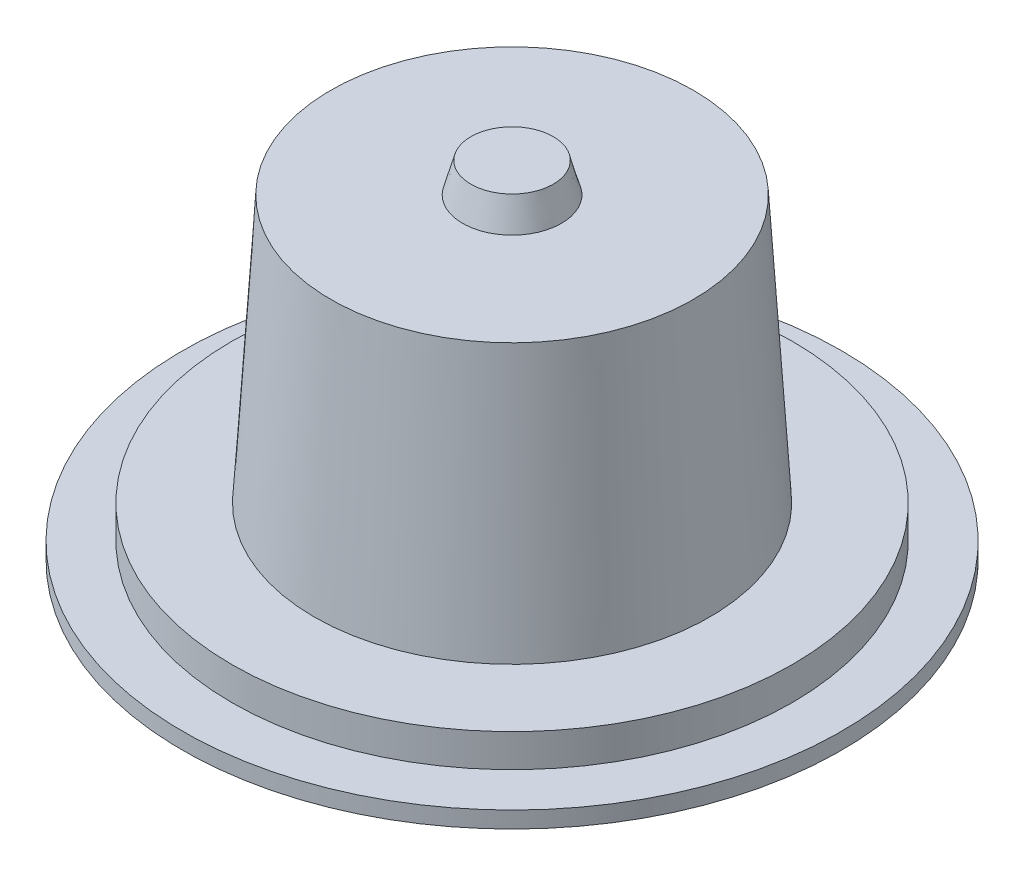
ISO-10303-21;
HEADER;
FILE_DESCRIPTION(('STEP AP214'),'2;1');
FILE_NAME('part.step','',(''),(''),'','','');
FILE_SCHEMA(('AUTOMOTIVE_DESIGN { 1 0 10303 214 1 1 1 1 }'));
ENDSEC;
DATA;
#1=APPLICATION_CONTEXT('core data for automotive mechanical design processes');
#2=APPLICATION_PROTOCOL_DEFINITION('international standard','automotive_design',2000,#1);
#3=PRODUCT_CONTEXT('',#1,'mechanical');
#4=PRODUCT('Part','Part','',(#3));
#5=PRODUCT_RELATED_PRODUCT_CATEGORY('part','',(#4));
#6=PRODUCT_DEFINITION_FORMATION('','',#4);
#7=PRODUCT_DEFINITION_CONTEXT('part definition',#1,'design');
#8=PRODUCT_DEFINITION('design','',#6,#7);
#9=PRODUCT_DEFINITION_SHAPE('','',#8);
#10=(LENGTH_UNIT() NAMED_UNIT(*) SI_UNIT(.MILLI.,.METRE.));
#11=(NAMED_UNIT(*) PLANE_ANGLE_UNIT() SI_UNIT($,.RADIAN.));
#12=(NAMED_UNIT(*) SI_UNIT($,.STERADIAN.) SOLID_ANGLE_UNIT());
#13=UNCERTAINTY_MEASURE_WITH_UNIT(LENGTH_MEASURE(1.E-05),#10,'distance_accuracy_value','');
#14=(GEOMETRIC_REPRESENTATION_CONTEXT(3) GLOBAL_UNCERTAINTY_ASSIGNED_CONTEXT((#13)) GLOBAL_UNIT_ASSIGNED_CONTEXT((#10,
#11,#12)) REPRESENTATION_CONTEXT('',''));
#15=CARTESIAN_POINT('',(0.,0.,0.));
#16=DIRECTION('',(0.,0.,1.));
#17=DIRECTION('',(1.,0.,0.));
#18=AXIS2_PLACEMENT_3D('',#15,#16,#17);
#19=CARTESIAN_POINT('',(0.,0.,0.));
#20=DIRECTION('',(0.,-1.,0.));
#21=DIRECTION('',(0.,0.,-1.));
#22=AXIS2_PLACEMENT_3D('',#19,#20,#21);
#23=CYLINDRICAL_SURFACE('',#22,50.);
#24=CARTESIAN_POINT('',(0.,10.,0.));
#25=DIRECTION('',(0.,-1.,0.));
#26=DIRECTION('',(0.,0.,-1.));
#27=AXIS2_PLACEMENT_3D('',#24,#25,#26);
#28=CIRCLE('',#27,50.);
#29=CARTESIAN_POINT('',(0.,10.,-50.));
#30=VERTEX_POINT('',#29);
#31=EDGE_CURVE('E10',#30,#30,#28,.T.);
#32=ORIENTED_EDGE('',*,*,#31,.F.);
#33=EDGE_LOOP('',(#32));
#34=FACE_BOUND('',#33,.T.);
#35=CARTESIAN_POINT('',(0.,0.,0.));
#36=DIRECTION('',(0.,-1.,0.));
#37=DIRECTION('',(0.,0.,-1.));
#38=AXIS2_PLACEMENT_3D('',#35,#36,#37);
#39=CIRCLE('',#38,50.);
#40=CARTESIAN_POINT('',(0.,0.,-50.));
#41=VERTEX_POINT('',#40);
#42=EDGE_CURVE('E88',#41,#41,#39,.T.);
#43=ORIENTED_EDGE('',*,*,#42,.T.);
#44=EDGE_LOOP('',(#43));
#45=FACE_BOUND('',#44,.T.);
#46=ADVANCED_FACE('F41',(#34,#45),#23,.F.);
#47=CARTESIAN_POINT('',(0.,10.,0.));
#48=DIRECTION('',(0.,1.,0.));
#49=DIRECTION('',(0.,0.,1.));
#50=AXIS2_PLACEMENT_3D('',#47,#48,#49);
#51=PLANE('',#50);
#52=ORIENTED_EDGE('',*,*,#31,.T.);
#53=EDGE_LOOP('',(#52));
#54=FACE_BOUND('',#53,.T.);
#55=ADVANCED_FACE('F106',(#54),#51,.F.);
#56=CARTESIAN_POINT('',(0.,110.,0.));
#57=DIRECTION('',(0.,-1.,0.));
#58=DIRECTION('',(0.,0.,-1.));
#59=AXIS2_PLACEMENT_3D('',#56,#57,#58);
#60=PLANE('',#59);
#61=CARTESIAN_POINT('',(0.,110.,0.));
#62=DIRECTION('',(0.,-1.,0.));
#63=DIRECTION('',(0.,0.,-1.));
#64=AXIS2_PLACEMENT_3D('',#61,#62,#63);
#65=CIRCLE('',#64,12.5);
#66=CARTESIAN_POINT('',(0.,110.,-12.5));
#67=VERTEX_POINT('',#66);
#68=EDGE_CURVE('E48',#67,#67,#65,.T.);
#69=ORIENTED_EDGE('',*,*,#68,.F.);
#70=EDGE_LOOP('',(#69));
#71=FACE_BOUND('',#70,.T.);
#72=ADVANCED_FACE('F111',(#71),#60,.F.);
#73=CARTESIAN_POINT('',(0.,110.,0.));
#74=DIRECTION('',(0.,-1.,0.));
#75=DIRECTION('',(0.,0.,-1.));
#76=AXIS2_PLACEMENT_3D('',#73,#74,#75);
#77=CONICAL_SURFACE('',#76,12.5,0.269701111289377);
#78=CARTESIAN_POINT('',(0.,100.956327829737,0.));
#79=DIRECTION('',(0.,-1.,0.));
#80=DIRECTION('',(0.,0.,-1.));
#81=AXIS2_PLACEMENT_3D('',#78,#79,#80);
#82=CIRCLE('',#81,15.);
#83=CARTESIAN_POINT('',(0.,100.956327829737,-15.));
#84=VERTEX_POINT('',#83);
#85=EDGE_CURVE('E53',#84,#84,#82,.T.);
#86=ORIENTED_EDGE('',*,*,#85,.F.);
#87=EDGE_LOOP('',(#86));
#88=FACE_BOUND('',#87,.T.);
#89=ORIENTED_EDGE('',*,*,#68,.T.);
#90=EDGE_LOOP('',(#89));
#91=FACE_BOUND('',#90,.T.);
#92=ADVANCED_FACE('F115',(#88,#91),#77,.T.);
#93=CARTESIAN_POINT('',(0.,100.956327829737,0.));
#94=DIRECTION('',(0.,-1.,0.));
#95=DIRECTION('',(0.,0.,-1.));
#96=AXIS2_PLACEMENT_3D('',#93,#94,#95);
#97=PLANE('',#96);
#98=CARTESIAN_POINT('',(0.,100.956327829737,0.));
#99=DIRECTION('',(0.,-1.,0.));
#100=DIRECTION('',(0.,0.,-1.));
#101=AXIS2_PLACEMENT_3D('',#98,#99,#100);
#102=CIRCLE('',#101,55.);
#103=CARTESIAN_POINT('',(0.,100.956327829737,-55.));
#104=VERTEX_POINT('',#103);
#105=EDGE_CURVE('E58',#104,#104,#102,.T.);
#106=ORIENTED_EDGE('',*,*,#105,.F.);
#107=EDGE_LOOP('',(#106));
#108=FACE_BOUND('',#107,.T.);
#109=ORIENTED_EDGE('',*,*,#85,.T.);
#110=EDGE_LOOP('',(#109));
#111=FACE_BOUND('',#110,.T.);
#112=ADVANCED_FACE('F121',(#108,#111),#97,.F.);
#113=CARTESIAN_POINT('',(0.,100.956327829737,0.));
#114=DIRECTION('',(0.,-1.,0.));
#115=DIRECTION('',(0.,0.,-1.));
#116=AXIS2_PLACEMENT_3D('',#113,#114,#115);
#117=CONICAL_SURFACE('',#116,55.,0.0616833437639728);
#118=CARTESIAN_POINT('',(0.,20.,0.));
#119=DIRECTION('',(0.,-1.,0.));
#120=DIRECTION('',(0.,0.,-1.));
#121=AXIS2_PLACEMENT_3D('',#118,#119,#120);
#122=CIRCLE('',#121,60.);
#123=CARTESIAN_POINT('',(0.,20.,-60.));
#124=VERTEX_POINT('',#123);
#125=EDGE_CURVE('E64',#124,#124,#122,.T.);
#126=ORIENTED_EDGE('',*,*,#125,.F.);
#127=EDGE_LOOP('',(#126));
#128=FACE_BOUND('',#127,.T.);
#129=ORIENTED_EDGE('',*,*,#105,.T.);
#130=EDGE_LOOP('',(#129));
#131=FACE_BOUND('',#130,.T.);
#132=ADVANCED_FACE('F125',(#128,#131),#117,.T.);
#133=CARTESIAN_POINT('',(0.,20.,0.));
#134=DIRECTION('',(0.,1.,0.));
#135=DIRECTION('',(0.,0.,1.));
#136=AXIS2_PLACEMENT_3D('',#133,#134,#135);
#137=PLANE('',#136);
#138=ORIENTED_EDGE('',*,*,#125,.T.);
#139=EDGE_LOOP('',(#138));
#140=FACE_BOUND('',#139,.T.);
#141=CARTESIAN_POINT('',(0.,20.,0.));
#142=DIRECTION('',(0.,-1.,0.));
#143=DIRECTION('',(0.,0.,-1.));
#144=AXIS2_PLACEMENT_3D('',#141,#142,#143);
#145=CIRCLE('',#144,85.);
#146=CARTESIAN_POINT('',(0.,20.,-85.));
#147=VERTEX_POINT('',#146);
#148=EDGE_CURVE('E68',#147,#147,#145,.T.);
#149=ORIENTED_EDGE('',*,*,#148,.F.);
#150=EDGE_LOOP('',(#149));
#151=FACE_BOUND('',#150,.T.);
#152=ADVANCED_FACE('F129',(#140,#151),#137,.T.);
#153=CARTESIAN_POINT('',(0.,0.,0.));
#154=DIRECTION('',(0.,-1.,0.));
#155=DIRECTION('',(0.,0.,-1.));
#156=AXIS2_PLACEMENT_3D('',#153,#154,#155);
#157=CYLINDRICAL_SURFACE('',#156,85.);
#158=ORIENTED_EDGE('',*,*,#148,.T.);
#159=EDGE_LOOP('',(#158));
#160=FACE_BOUND('',#159,.T.);
#161=CARTESIAN_POINT('',(0.,10.,0.));
#162=DIRECTION('',(0.,-1.,0.));
#163=DIRECTION('',(0.,0.,-1.));
#164=AXIS2_PLACEMENT_3D('',#161,#162,#163);
#165=CIRCLE('',#164,85.);
#166=CARTESIAN_POINT('',(0.,10.,-85.));
#167=VERTEX_POINT('',#166);
#168=EDGE_CURVE('E72',#167,#167,#165,.T.);
#169=ORIENTED_EDGE('',*,*,#168,.F.);
#170=EDGE_LOOP('',(#169));
#171=FACE_BOUND('',#170,.T.);
#172=ADVANCED_FACE('F133',(#160,#171),#157,.T.);
#173=CARTESIAN_POINT('',(0.,10.,0.));
#174=DIRECTION('',(0.,1.,0.));
#175=DIRECTION('',(0.,0.,1.));
#176=AXIS2_PLACEMENT_3D('',#173,#174,#175);
#177=PLANE('',#176);
#178=ORIENTED_EDGE('',*,*,#168,.T.);
#179=EDGE_LOOP('',(#178));
#180=FACE_BOUND('',#179,.T.);
#181=CARTESIAN_POINT('',(0.,10.,0.));
#182=DIRECTION('',(0.,-1.,0.));
#183=DIRECTION('',(0.,0.,-1.));
#184=AXIS2_PLACEMENT_3D('',#181,#182,#183);
#185=CIRCLE('',#184,100.);
#186=CARTESIAN_POINT('',(0.,10.,-100.));
#187=VERTEX_POINT('',#186);
#188=EDGE_CURVE('E76',#187,#187,#185,.T.);
#189=ORIENTED_EDGE('',*,*,#188,.F.);
#190=EDGE_LOOP('',(#189));
#191=FACE_BOUND('',#190,.T.);
#192=ADVANCED_FACE('F137',(#180,#191),#177,.T.);
#193=CARTESIAN_POINT('',(0.,0.,0.));
#194=DIRECTION('',(0.,-1.,0.));
#195=DIRECTION('',(0.,0.,-1.));
#196=AXIS2_PLACEMENT_3D('',#193,#194,#195);
#197=CYLINDRICAL_SURFACE('',#196,100.);
#198=ORIENTED_EDGE('',*,*,#188,.T.);
#199=EDGE_LOOP('',(#198));
#200=FACE_BOUND('',#199,.T.);
#201=CARTESIAN_POINT('',(0.,5.,0.));
#202=DIRECTION('',(0.,-1.,0.));
#203=DIRECTION('',(0.,0.,-1.));
#204=AXIS2_PLACEMENT_3D('',#201,#202,#203);
#205=CIRCLE('',#204,100.);
#206=CARTESIAN_POINT('',(0.,5.,-100.));
#207=VERTEX_POINT('',#206);
#208=EDGE_CURVE('E80',#207,#207,#205,.T.);
#209=ORIENTED_EDGE('',*,*,#208,.F.);
#210=EDGE_LOOP('',(#209));
#211=FACE_BOUND('',#210,.T.);
#212=ADVANCED_FACE('F102',(#200,#211),#197,.T.);
#213=CARTESIAN_POINT('',(0.,0.,0.));
#214=DIRECTION('',(0.,1.,0.));
#215=DIRECTION('',(0.,0.,1.));
#216=AXIS2_PLACEMENT_3D('',#213,#214,#215);
#217=CONICAL_SURFACE('',#216,90.,1.10714871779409);
#218=ORIENTED_EDGE('',*,*,#208,.T.);
#219=EDGE_LOOP('',(#218));
#220=FACE_BOUND('',#219,.T.);
#221=CARTESIAN_POINT('',(0.,0.,0.));
#222=DIRECTION('',(0.,-1.,0.));
#223=DIRECTION('',(0.,0.,-1.));
#224=AXIS2_PLACEMENT_3D('',#221,#222,#223);
#225=CIRCLE('',#224,90.);
#226=CARTESIAN_POINT('',(0.,0.,-90.));
#227=VERTEX_POINT('',#226);
#228=EDGE_CURVE('E84',#227,#227,#225,.T.);
#229=ORIENTED_EDGE('',*,*,#228,.F.);
#230=EDGE_LOOP('',(#229));
#231=FACE_BOUND('',#230,.T.);
#232=ADVANCED_FACE('F96',(#220,#231),#217,.T.);
#233=CARTESIAN_POINT('',(0.,0.,0.));
#234=DIRECTION('',(0.,-1.,0.));
#235=DIRECTION('',(0.,0.,-1.));
#236=AXIS2_PLACEMENT_3D('',#233,#234,#235);
#237=PLANE('',#236);
#238=ORIENTED_EDGE('',*,*,#228,.T.);
#239=EDGE_LOOP('',(#238));
#240=FACE_BOUND('',#239,.T.);
#241=ORIENTED_EDGE('',*,*,#42,.F.);
#242=EDGE_LOOP('',(#241));
#243=FACE_BOUND('',#242,.T.);
#244=ADVANCED_FACE('F94',(#240,#243),#237,.T.);
#245=CLOSED_SHELL('',(#46,#55,#72,#92,#112,#132,#152,#172,#192,#212,#232,#244));
#246=MANIFOLD_SOLID_BREP('B2',#245);
#247=ADVANCED_BREP_SHAPE_REPRESENTATION('',(#18,#246),#14);
#248=SHAPE_DEFINITION_REPRESENTATION(#9,#247);
ENDSEC;
END-ISO-10303-21;
